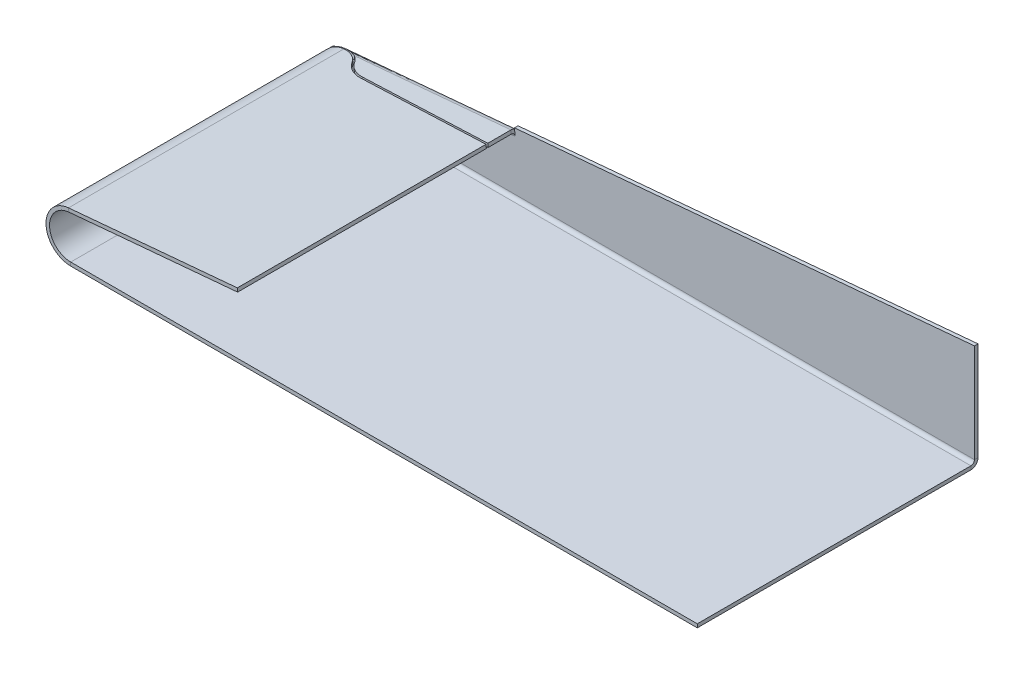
ISO-10303-21;
HEADER;
FILE_DESCRIPTION(('STEP AP214'),'2;1');
FILE_NAME('part.step','',(''),(''),'','','');
FILE_SCHEMA(('AUTOMOTIVE_DESIGN { 1 0 10303 214 1 1 1 1 }'));
ENDSEC;
DATA;
#1=APPLICATION_CONTEXT('core data for automotive mechanical design processes');
#2=APPLICATION_PROTOCOL_DEFINITION('international standard','automotive_design',2000,#1);
#3=PRODUCT_CONTEXT('',#1,'mechanical');
#4=PRODUCT('Part','Part','',(#3));
#5=PRODUCT_RELATED_PRODUCT_CATEGORY('part','',(#4));
#6=PRODUCT_DEFINITION_FORMATION('','',#4);
#7=PRODUCT_DEFINITION_CONTEXT('part definition',#1,'design');
#8=PRODUCT_DEFINITION('design','',#6,#7);
#9=PRODUCT_DEFINITION_SHAPE('','',#8);
#10=(LENGTH_UNIT() NAMED_UNIT(*) SI_UNIT(.MILLI.,.METRE.));
#11=(NAMED_UNIT(*) PLANE_ANGLE_UNIT() SI_UNIT($,.RADIAN.));
#12=(NAMED_UNIT(*) SI_UNIT($,.STERADIAN.) SOLID_ANGLE_UNIT());
#13=UNCERTAINTY_MEASURE_WITH_UNIT(LENGTH_MEASURE(1.E-05),#10,'distance_accuracy_value','');
#14=(GEOMETRIC_REPRESENTATION_CONTEXT(3) GLOBAL_UNCERTAINTY_ASSIGNED_CONTEXT((#13)) GLOBAL_UNIT_ASSIGNED_CONTEXT((#10,
#11,#12)) REPRESENTATION_CONTEXT('',''));
#15=CARTESIAN_POINT('',(0.,0.,0.));
#16=DIRECTION('',(0.,0.,1.));
#17=DIRECTION('',(1.,0.,0.));
#18=AXIS2_PLACEMENT_3D('',#15,#16,#17);
#19=CARTESIAN_POINT('',(69.1480775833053,-165.160090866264,79.));
#20=DIRECTION('',(-0.996024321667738,-0.0890817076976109,0.));
#21=DIRECTION('',(0.0890817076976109,-0.996024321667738,0.));
#22=AXIS2_PLACEMENT_3D('',#19,#20,#21);
#23=PLANE('',#22);
#24=DIRECTION('',(-0.0890817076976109,0.996024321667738,0.));
#25=VECTOR('',#24,1.);
#26=CARTESIAN_POINT('',(69.1480775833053,-165.160090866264,9.013286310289));
#27=LINE('',#26,#25);
#28=CARTESIAN_POINT('',(52.9358370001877,16.1092891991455,9.01328631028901));
#29=VERTEX_POINT('',#28);
#30=CARTESIAN_POINT('',(52.84675529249,17.1053135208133,9.01328631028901));
#31=VERTEX_POINT('',#30);
#32=EDGE_CURVE('E325',#29,#31,#27,.T.);
#33=ORIENTED_EDGE('',*,*,#32,.T.);
#34=DIRECTION('',(0.,0.,1.));
#35=VECTOR('',#34,1.);
#36=CARTESIAN_POINT('',(52.8467552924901,17.1053135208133,79.));
#37=LINE('',#36,#35);
#38=CARTESIAN_POINT('',(52.84675529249,17.1053135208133,79.));
#39=VERTEX_POINT('',#38);
#40=EDGE_CURVE('E321',#31,#39,#37,.T.);
#41=ORIENTED_EDGE('',*,*,#40,.T.);
#42=DIRECTION('',(-0.0890817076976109,0.996024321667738,0.));
#43=VECTOR('',#42,1.);
#44=CARTESIAN_POINT('',(69.1480775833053,-165.160090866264,79.));
#45=LINE('',#44,#43);
#46=CARTESIAN_POINT('',(52.9358370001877,16.1092891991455,79.));
#47=VERTEX_POINT('',#46);
#48=EDGE_CURVE('E307',#47,#39,#45,.T.);
#49=ORIENTED_EDGE('',*,*,#48,.F.);
#50=DIRECTION('',(0.,0.,-1.));
#51=VECTOR('',#50,1.);
#52=CARTESIAN_POINT('',(52.9358370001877,16.1092891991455,79.));
#53=LINE('',#52,#51);
#54=EDGE_CURVE('E295',#29,#47,#53,.F.);
#55=ORIENTED_EDGE('',*,*,#54,.F.);
#56=EDGE_LOOP('',(#33,#41,#49,#55));
#57=FACE_BOUND('',#56,.T.);
#58=ADVANCED_FACE('F39',(#57),#23,.F.);
#59=CARTESIAN_POINT('',(25.1575423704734,-169.094484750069,6.8574243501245));
#60=DIRECTION('',(-0.048560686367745,-0.0043431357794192,0.998810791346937));
#61=DIRECTION('',(-0.99483984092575,-0.0889757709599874,-0.0487545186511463));
#62=AXIS2_PLACEMENT_3D('',#59,#60,#61);
#63=PLANE('',#62);
#64=DIRECTION('',(-0.0890817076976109,0.996024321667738,0.));
#65=VECTOR('',#64,1.);
#66=CARTESIAN_POINT('',(31.9674002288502,-168.485429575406,7.19115780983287));
#67=LINE('',#66,#65);
#68=CARTESIAN_POINT('',(15.7551596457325,12.7839504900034,7.19115780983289));
#69=VERTEX_POINT('',#68);
#70=CARTESIAN_POINT('',(15.6660779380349,13.7799748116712,7.19115780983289));
#71=VERTEX_POINT('',#70);
#72=EDGE_CURVE('E318',#69,#71,#67,.T.);
#73=ORIENTED_EDGE('',*,*,#72,.T.);
#74=DIRECTION('',(-0.99483984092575,-0.0889757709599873,-0.0487545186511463));
#75=VECTOR('',#74,1.);
#76=CARTESIAN_POINT('',(182.264421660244,28.6800777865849,15.355710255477));
#77=LINE('',#76,#75);
#78=EDGE_CURVE('E312',#31,#71,#77,.T.);
#79=ORIENTED_EDGE('',*,*,#78,.F.);
#80=ORIENTED_EDGE('',*,*,#32,.F.);
#81=DIRECTION('',(0.99483984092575,0.0889757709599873,0.0487545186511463));
#82=VECTOR('',#81,1.);
#83=CARTESIAN_POINT('',(8.94530178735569,12.1748953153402,6.85742435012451));
#84=LINE('',#83,#82);
#85=EDGE_CURVE('E299',#69,#29,#84,.T.);
#86=ORIENTED_EDGE('',*,*,#85,.F.);
#87=EDGE_LOOP('',(#73,#79,#80,#86));
#88=FACE_BOUND('',#87,.T.);
#89=ADVANCED_FACE('F353',(#88),#63,.F.);
#90=CARTESIAN_POINT('',(32.304610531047,-168.455270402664,0.255314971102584));
#91=DIRECTION('',(-0.0890817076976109,0.996024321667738,0.));
#92=DIRECTION('',(0.,0.,-1.));
#93=AXIS2_PLACEMENT_3D('',#90,#91,#92);
#94=CYLINDRICAL_SURFACE('',#93,6.94410082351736);
#95=DIRECTION('',(-0.0890817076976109,0.996024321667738,0.));
#96=VECTOR('',#95,1.);
#97=CARTESIAN_POINT('',(26.5639999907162,-168.968695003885,4.12859808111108));
#98=LINE('',#97,#96);
#99=CARTESIAN_POINT('',(10.3517594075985,12.300685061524,4.12859808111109));
#100=VERTEX_POINT('',#99);
#101=CARTESIAN_POINT('',(10.2626776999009,13.2967093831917,4.12859808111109));
#102=VERTEX_POINT('',#101);
#103=EDGE_CURVE('E315',#100,#102,#98,.T.);
#104=ORIENTED_EDGE('',*,*,#103,.T.);
#105=CARTESIAN_POINT('',(16.0032882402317,13.8101339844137,0.255314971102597));
#106=DIRECTION('',(-0.0890817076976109,0.996024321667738,0.));
#107=DIRECTION('',(0.996024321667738,0.0890817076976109,0.));
#108=AXIS2_PLACEMENT_3D('',#105,#106,#107);
#109=CIRCLE('',#108,6.94410082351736);
#110=EDGE_CURVE('E310',#71,#102,#109,.F.);
#111=ORIENTED_EDGE('',*,*,#110,.F.);
#112=ORIENTED_EDGE('',*,*,#72,.F.);
#113=CARTESIAN_POINT('',(16.0923699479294,12.8141096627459,0.255314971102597));
#114=DIRECTION('',(0.0890817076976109,-0.996024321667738,0.));
#115=DIRECTION('',(0.996024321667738,0.0890817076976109,0.));
#116=AXIS2_PLACEMENT_3D('',#113,#114,#115);
#117=CIRCLE('',#116,6.94410082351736);
#118=EDGE_CURVE('E302',#100,#69,#117,.F.);
#119=ORIENTED_EDGE('',*,*,#118,.F.);
#120=EDGE_LOOP('',(#104,#111,#112,#119));
#121=FACE_BOUND('',#120,.T.);
#122=ADVANCED_FACE('F350',(#121),#94,.F.);
#123=CARTESIAN_POINT('',(21.6500782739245,-169.408182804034,7.44410082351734));
#124=DIRECTION('',(-0.0890817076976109,0.996024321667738,0.));
#125=DIRECTION('',(0.,0.,-1.));
#126=AXIS2_PLACEMENT_3D('',#123,#124,#125);
#127=CYLINDRICAL_SURFACE('',#126,5.94410082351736);
#128=CARTESIAN_POINT('',(5.34875598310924,12.8572215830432,1.5));
#129=CARTESIAN_POINT('',(5.43783769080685,11.8611972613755,1.5));
#130=B_SPLINE_CURVE_WITH_KNOTS('',1,(#128,#129),.UNSPECIFIED.,.F.,.F.,(2,2),(0.,1.),.UNSPECIFIED.);
#131=CARTESIAN_POINT('',(5.43783769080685,11.8611972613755,1.5));
#132=VERTEX_POINT('',#131);
#133=CARTESIAN_POINT('',(5.34875598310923,12.8572215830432,1.5));
#134=VERTEX_POINT('',#133);
#135=EDGE_CURVE('E314',#132,#134,#130,.F.);
#136=ORIENTED_EDGE('',*,*,#135,.T.);
#137=CARTESIAN_POINT('',(5.34875598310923,12.8572215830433,7.44410082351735));
#138=DIRECTION('',(-0.0890817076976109,0.996024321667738,0.));
#139=DIRECTION('',(0.996024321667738,0.0890817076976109,0.));
#140=AXIS2_PLACEMENT_3D('',#137,#138,#139);
#141=CIRCLE('',#140,5.94410082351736);
#142=EDGE_CURVE('E309',#102,#134,#141,.T.);
#143=ORIENTED_EDGE('',*,*,#142,.F.);
#144=ORIENTED_EDGE('',*,*,#103,.F.);
#145=CARTESIAN_POINT('',(5.43783769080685,11.8611972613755,7.44410082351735));
#146=DIRECTION('',(0.0890817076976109,-0.996024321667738,0.));
#147=DIRECTION('',(0.996024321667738,0.0890817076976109,0.));
#148=AXIS2_PLACEMENT_3D('',#145,#146,#147);
#149=CIRCLE('',#148,5.94410082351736);
#150=EDGE_CURVE('E11',#132,#100,#149,.T.);
#151=ORIENTED_EDGE('',*,*,#150,.F.);
#152=EDGE_LOOP('',(#136,#143,#144,#151));
#153=FACE_BOUND('',#152,.T.);
#154=ADVANCED_FACE('F342',(#153),#127,.T.);
#155=CARTESIAN_POINT('',(5.34875598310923,12.8572215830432,79.));
#156=DIRECTION('',(0.0890817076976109,-0.996024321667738,0.));
#157=DIRECTION('',(0.996024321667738,0.0890817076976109,0.));
#158=AXIS2_PLACEMENT_3D('',#155,#156,#157);
#159=PLANE('',#158);
#160=ORIENTED_EDGE('',*,*,#78,.T.);
#161=ORIENTED_EDGE('',*,*,#110,.T.);
#162=ORIENTED_EDGE('',*,*,#142,.T.);
#163=DIRECTION('',(0.,0.,-1.));
#164=VECTOR('',#163,1.);
#165=CARTESIAN_POINT('',(5.34875598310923,12.8572215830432,79.));
#166=LINE('',#165,#164);
#167=CARTESIAN_POINT('',(5.34875598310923,12.8572215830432,79.));
#168=VERTEX_POINT('',#167);
#169=EDGE_CURVE('E255',#168,#134,#166,.T.);
#170=ORIENTED_EDGE('',*,*,#169,.F.);
#171=DIRECTION('',(-0.996024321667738,-0.0890817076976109,0.));
#172=VECTOR('',#171,1.);
#173=CARTESIAN_POINT('',(5.34875598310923,12.8572215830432,79.));
#174=LINE('',#173,#172);
#175=EDGE_CURVE('E305',#39,#168,#174,.T.);
#176=ORIENTED_EDGE('',*,*,#175,.F.);
#177=ORIENTED_EDGE('',*,*,#40,.F.);
#178=EDGE_LOOP('',(#160,#161,#162,#170,#176,#177));
#179=FACE_BOUND('',#178,.T.);
#180=ADVANCED_FACE('F345',(#179),#159,.F.);
#181=CARTESIAN_POINT('',(21.6500782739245,-169.408182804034,79.));
#182=DIRECTION('',(0.,0.,-1.));
#183=DIRECTION('',(0.089081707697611,-0.996024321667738,0.));
#184=AXIS2_PLACEMENT_3D('',#181,#182,#183);
#185=PLANE('',#184);
#186=ORIENTED_EDGE('',*,*,#48,.T.);
#187=ORIENTED_EDGE('',*,*,#175,.T.);
#188=DIRECTION('',(-0.0890817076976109,0.996024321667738,0.));
#189=VECTOR('',#188,1.);
#190=CARTESIAN_POINT('',(21.6500782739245,-169.408182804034,79.));
#191=LINE('',#190,#189);
#192=CARTESIAN_POINT('',(5.43783769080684,11.8611972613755,79.));
#193=VERTEX_POINT('',#192);
#194=EDGE_CURVE('E91',#193,#168,#191,.T.);
#195=ORIENTED_EDGE('',*,*,#194,.F.);
#196=DIRECTION('',(-0.996024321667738,-0.0890817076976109,0.));
#197=VECTOR('',#196,1.);
#198=CARTESIAN_POINT('',(5.43783769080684,11.8611972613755,79.));
#199=LINE('',#198,#197);
#200=EDGE_CURVE('E60',#47,#193,#199,.T.);
#201=ORIENTED_EDGE('',*,*,#200,.F.);
#202=EDGE_LOOP('',(#186,#187,#195,#201));
#203=FACE_BOUND('',#202,.T.);
#204=ADVANCED_FACE('F704',(#203),#185,.F.);
#205=CARTESIAN_POINT('',(5.43783769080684,11.8611972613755,79.));
#206=DIRECTION('',(0.0890817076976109,-0.996024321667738,0.));
#207=DIRECTION('',(0.996024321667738,0.0890817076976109,0.));
#208=AXIS2_PLACEMENT_3D('',#205,#206,#207);
#209=PLANE('',#208);
#210=ORIENTED_EDGE('',*,*,#118,.T.);
#211=ORIENTED_EDGE('',*,*,#85,.T.);
#212=ORIENTED_EDGE('',*,*,#54,.T.);
#213=ORIENTED_EDGE('',*,*,#200,.T.);
#214=DIRECTION('',(0.,0.,-1.));
#215=VECTOR('',#214,1.);
#216=CARTESIAN_POINT('',(5.43783769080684,11.8611972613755,79.));
#217=LINE('',#216,#215);
#218=EDGE_CURVE('E51',#193,#132,#217,.T.);
#219=ORIENTED_EDGE('',*,*,#218,.T.);
#220=ORIENTED_EDGE('',*,*,#150,.T.);
#221=EDGE_LOOP('',(#210,#211,#212,#213,#219,#220));
#222=FACE_BOUND('',#221,.T.);
#223=ADVANCED_FACE('F41',(#222),#209,.T.);
#224=CARTESIAN_POINT('',(24.1597591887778,-77.3875277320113,0.255314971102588));
#225=DIRECTION('',(-0.089081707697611,0.996024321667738,0.));
#226=DIRECTION('',(0.0887275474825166,0.00793555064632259,0.996024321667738));
#227=AXIS2_PLACEMENT_3D('',#224,#225,#226);
#228=CYLINDRICAL_SURFACE('',#227,6.44410082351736);
#229=CARTESIAN_POINT('',(16.0032882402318,13.8101339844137,0.255314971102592));
#230=DIRECTION('',(0.089081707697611,-0.996024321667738,0.));
#231=DIRECTION('',(0.996024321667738,0.089081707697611,0.));
#232=AXIS2_PLACEMENT_3D('',#229,#230,#231);
#233=CIRCLE('',#232,6.44410082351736);
#234=CARTESIAN_POINT('',(15.6903582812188,13.7821463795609,6.69175241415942));
#235=VERTEX_POINT('',#234);
#236=CARTESIAN_POINT('',(10.6760221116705,13.3336777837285,3.84970789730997));
#237=VERTEX_POINT('',#236);
#238=EDGE_CURVE('E1089',#235,#237,#233,.T.);
#239=ORIENTED_EDGE('',*,*,#238,.T.);
#240=DIRECTION('',(-0.089081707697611,0.996024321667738,0.));
#241=VECTOR('',#240,1.);
#242=CARTESIAN_POINT('',(18.8324930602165,-77.8639839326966,3.84970789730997));
#243=LINE('',#242,#241);
#244=CARTESIAN_POINT('',(10.7651038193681,12.3376534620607,3.84970789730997));
#245=VERTEX_POINT('',#244);
#246=EDGE_CURVE('E1070',#245,#237,#243,.T.);
#247=ORIENTED_EDGE('',*,*,#246,.F.);
#248=CARTESIAN_POINT('',(16.0923699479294,12.8141096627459,0.255314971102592));
#249=DIRECTION('',(0.089081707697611,-0.996024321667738,0.));
#250=DIRECTION('',(0.996024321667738,0.089081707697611,0.));
#251=AXIS2_PLACEMENT_3D('',#248,#249,#250);
#252=CIRCLE('',#251,6.44410082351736);
#253=CARTESIAN_POINT('',(15.7794399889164,12.7861220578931,6.69175241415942));
#254=VERTEX_POINT('',#253);
#255=EDGE_CURVE('E104',#245,#254,#252,.F.);
#256=ORIENTED_EDGE('',*,*,#255,.T.);
#257=DIRECTION('',(-0.089081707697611,0.996024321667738,0.));
#258=VECTOR('',#257,1.);
#259=CARTESIAN_POINT('',(23.8468292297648,-77.4155153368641,6.69175241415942));
#260=LINE('',#259,#258);
#261=EDGE_CURVE('E1086',#254,#235,#260,.T.);
#262=ORIENTED_EDGE('',*,*,#261,.T.);
#263=EDGE_LOOP('',(#239,#247,#256,#262));
#264=FACE_BOUND('',#263,.T.);
#265=ADVANCED_FACE('F603',(#264),#228,.T.);
#266=CARTESIAN_POINT('',(17.036971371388,-78.0245705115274,6.35801895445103));
#267=DIRECTION('',(-0.048560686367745,-0.00434313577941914,0.998810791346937));
#268=DIRECTION('',(-0.99483984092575,-0.0889757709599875,-0.0487545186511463));
#269=AXIS2_PLACEMENT_3D('',#266,#267,#268);
#270=PLANE('',#269);
#271=DIRECTION('',(-0.99483984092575,-0.0889757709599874,-0.0487545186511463));
#272=VECTOR('',#271,1.);
#273=CARTESIAN_POINT('',(182.288702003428,28.6822493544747,14.8563048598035));
#274=LINE('',#273,#272);
#275=CARTESIAN_POINT('',(52.8467552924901,17.1053135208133,8.51269099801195));
#276=VERTEX_POINT('',#275);
#277=EDGE_CURVE('E125',#276,#235,#274,.T.);
#278=ORIENTED_EDGE('',*,*,#277,.T.);
#279=ORIENTED_EDGE('',*,*,#261,.F.);
#280=DIRECTION('',(0.99483984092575,0.0889757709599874,0.0487545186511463));
#281=VECTOR('',#280,1.);
#282=CARTESIAN_POINT('',(8.96958213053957,12.1770668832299,6.35801895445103));
#283=LINE('',#282,#281);
#284=CARTESIAN_POINT('',(52.9358370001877,16.1092891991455,8.51269099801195));
#285=VERTEX_POINT('',#284);
#286=EDGE_CURVE('E1082',#254,#285,#283,.T.);
#287=ORIENTED_EDGE('',*,*,#286,.T.);
#288=DIRECTION('',(-0.089081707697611,0.996024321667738,0.));
#289=VECTOR('',#288,1.);
#290=CARTESIAN_POINT('',(61.0032262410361,-74.0923481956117,8.51269099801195));
#291=LINE('',#290,#289);
#292=EDGE_CURVE('E1080',#285,#276,#291,.T.);
#293=ORIENTED_EDGE('',*,*,#292,.T.);
#294=EDGE_LOOP('',(#278,#279,#287,#293));
#295=FACE_BOUND('',#294,.T.);
#296=ADVANCED_FACE('F606',(#295),#270,.T.);
#297=CARTESIAN_POINT('',(61.0032262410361,-74.0923481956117,79.));
#298=DIRECTION('',(-0.996024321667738,-0.089081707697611,0.));
#299=DIRECTION('',(0.,0.,-1.));
#300=AXIS2_PLACEMENT_3D('',#297,#298,#299);
#301=PLANE('',#300);
#302=DIRECTION('',(-0.089081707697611,0.996024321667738,0.));
#303=VECTOR('',#302,1.);
#304=CARTESIAN_POINT('',(61.0032262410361,-74.0923481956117,1.99999999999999));
#305=LINE('',#304,#303);
#306=CARTESIAN_POINT('',(52.9358370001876,16.1092891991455,2.));
#307=VERTEX_POINT('',#306);
#308=CARTESIAN_POINT('',(52.84675529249,17.1053135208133,2.));
#309=VERTEX_POINT('',#308);
#310=EDGE_CURVE('E1058',#307,#309,#305,.T.);
#311=ORIENTED_EDGE('',*,*,#310,.T.);
#312=DIRECTION('',(0.,0.,1.));
#313=VECTOR('',#312,1.);
#314=CARTESIAN_POINT('',(52.8467552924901,17.1053135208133,79.));
#315=LINE('',#314,#313);
#316=EDGE_CURVE('E1052',#309,#276,#315,.T.);
#317=ORIENTED_EDGE('',*,*,#316,.T.);
#318=ORIENTED_EDGE('',*,*,#292,.F.);
#319=DIRECTION('',(0.,0.,-1.));
#320=VECTOR('',#319,1.);
#321=CARTESIAN_POINT('',(52.9358370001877,16.1092891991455,79.));
#322=LINE('',#321,#320);
#323=EDGE_CURVE('E329',#307,#285,#322,.F.);
#324=ORIENTED_EDGE('',*,*,#323,.F.);
#325=EDGE_LOOP('',(#311,#317,#318,#324));
#326=FACE_BOUND('',#325,.T.);
#327=ADVANCED_FACE('F610',(#326),#301,.F.);
#328=CARTESIAN_POINT('',(5.34875598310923,12.8572215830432,79.));
#329=DIRECTION('',(0.089081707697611,-0.996024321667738,0.));
#330=DIRECTION('',(0.996024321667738,0.089081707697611,0.));
#331=AXIS2_PLACEMENT_3D('',#328,#329,#330);
#332=PLANE('',#331);
#333=ORIENTED_EDGE('',*,*,#316,.F.);
#334=DIRECTION('',(-0.996024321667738,-0.089081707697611,0.));
#335=VECTOR('',#334,1.);
#336=CARTESIAN_POINT('',(52.8467552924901,17.1053135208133,1.99999999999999));
#337=LINE('',#336,#335);
#338=CARTESIAN_POINT('',(8.78297528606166,13.1643688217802,2.));
#339=VERTEX_POINT('',#338);
#340=EDGE_CURVE('E1048',#309,#339,#337,.T.);
#341=ORIENTED_EDGE('',*,*,#340,.T.);
#342=CARTESIAN_POINT('',(5.34875598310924,12.8572215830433,7.44410082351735));
#343=DIRECTION('',(-0.089081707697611,0.996024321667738,0.));
#344=DIRECTION('',(-0.996024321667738,-0.089081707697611,0.));
#345=AXIS2_PLACEMENT_3D('',#342,#343,#344);
#346=CIRCLE('',#345,6.44410082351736);
#347=EDGE_CURVE('E1051',#237,#339,#346,.T.);
#348=ORIENTED_EDGE('',*,*,#347,.F.);
#349=ORIENTED_EDGE('',*,*,#238,.F.);
#350=ORIENTED_EDGE('',*,*,#277,.F.);
#351=EDGE_LOOP('',(#333,#341,#348,#349,#350));
#352=FACE_BOUND('',#351,.T.);
#353=ADVANCED_FACE('F613',(#352),#332,.F.);
#354=CARTESIAN_POINT('',(13.5052269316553,-78.3404401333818,7.44410082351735));
#355=DIRECTION('',(-0.089081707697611,0.996024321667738,0.));
#356=DIRECTION('',(0.0887275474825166,0.00793555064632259,0.996024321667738));
#357=AXIS2_PLACEMENT_3D('',#354,#355,#356);
#358=CYLINDRICAL_SURFACE('',#357,6.44410082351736);
#359=ORIENTED_EDGE('',*,*,#347,.T.);
#360=CARTESIAN_POINT('',(8.87205699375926,12.1683445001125,2.));
#361=CARTESIAN_POINT('',(8.78297528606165,13.1643688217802,2.));
#362=B_SPLINE_CURVE_WITH_KNOTS('',1,(#360,#361),.UNSPECIFIED.,.F.,.F.,(2,2),(0.,1.),.UNSPECIFIED.);
#363=CARTESIAN_POINT('',(8.87205699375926,12.1683445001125,2.));
#364=VERTEX_POINT('',#363);
#365=EDGE_CURVE('E1067',#364,#339,#362,.T.);
#366=ORIENTED_EDGE('',*,*,#365,.F.);
#367=CARTESIAN_POINT('',(5.43783769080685,11.8611972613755,7.44410082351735));
#368=DIRECTION('',(0.089081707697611,-0.996024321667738,0.));
#369=DIRECTION('',(-0.0887275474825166,-0.00793555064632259,-0.996024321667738));
#370=AXIS2_PLACEMENT_3D('',#367,#368,#369);
#371=CIRCLE('',#370,6.44410082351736);
#372=EDGE_CURVE('E1055',#364,#245,#371,.T.);
#373=ORIENTED_EDGE('',*,*,#372,.T.);
#374=ORIENTED_EDGE('',*,*,#246,.T.);
#375=EDGE_LOOP('',(#359,#366,#373,#374));
#376=FACE_BOUND('',#375,.T.);
#377=ADVANCED_FACE('F617',(#376),#358,.F.);
#378=CARTESIAN_POINT('',(5.43783769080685,11.8611972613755,79.));
#379=DIRECTION('',(0.089081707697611,-0.996024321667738,0.));
#380=DIRECTION('',(0.996024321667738,0.089081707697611,0.));
#381=AXIS2_PLACEMENT_3D('',#378,#379,#380);
#382=PLANE('',#381);
#383=DIRECTION('',(-0.996024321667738,-0.089081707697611,0.));
#384=VECTOR('',#383,1.);
#385=CARTESIAN_POINT('',(52.9358370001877,16.1092891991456,1.99999999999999));
#386=LINE('',#385,#384);
#387=EDGE_CURVE('E1065',#307,#364,#386,.T.);
#388=ORIENTED_EDGE('',*,*,#387,.F.);
#389=ORIENTED_EDGE('',*,*,#323,.T.);
#390=ORIENTED_EDGE('',*,*,#286,.F.);
#391=ORIENTED_EDGE('',*,*,#255,.F.);
#392=ORIENTED_EDGE('',*,*,#372,.F.);
#393=EDGE_LOOP('',(#388,#389,#390,#391,#392));
#394=FACE_BOUND('',#393,.T.);
#395=ADVANCED_FACE('F622',(#394),#382,.T.);
#396=CARTESIAN_POINT('',(52.8467552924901,17.1053135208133,0.999999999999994));
#397=DIRECTION('',(0.996024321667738,0.0890817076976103,0.));
#398=DIRECTION('',(-0.0890817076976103,0.996024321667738,0.));
#399=AXIS2_PLACEMENT_3D('',#396,#397,#398);
#400=PLANE('',#399);
#401=CARTESIAN_POINT('',(53.0249187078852,15.1132648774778,2.));
#402=DIRECTION('',(-0.996024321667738,-0.089081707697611,0.));
#403=DIRECTION('',(0.089081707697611,-0.996024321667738,0.));
#404=AXIS2_PLACEMENT_3D('',#401,#402,#403);
#405=CIRCLE('',#404,2.);
#406=CARTESIAN_POINT('',(52.8706246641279,16.8384296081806,0.999999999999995));
#407=VERTEX_POINT('',#406);
#408=CARTESIAN_POINT('',(53.0249187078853,15.1132648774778,0.));
#409=VERTEX_POINT('',#408);
#410=EDGE_CURVE('E141',#407,#409,#405,.T.);
#411=ORIENTED_EDGE('',*,*,#410,.F.);
#412=DIRECTION('',(0.0890817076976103,-0.996024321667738,0.));
#413=VECTOR('',#412,1.);
#414=CARTESIAN_POINT('',(52.8467552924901,17.1053135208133,0.999999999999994));
#415=LINE('',#414,#413);
#416=CARTESIAN_POINT('',(52.8467552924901,17.1053135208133,0.999999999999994));
#417=VERTEX_POINT('',#416);
#418=EDGE_CURVE('E514',#417,#407,#415,.T.);
#419=ORIENTED_EDGE('',*,*,#418,.F.);
#420=DIRECTION('',(0.,0.,-1.));
#421=VECTOR('',#420,1.);
#422=CARTESIAN_POINT('',(52.8467552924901,17.1053135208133,0.999999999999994));
#423=LINE('',#422,#421);
#424=CARTESIAN_POINT('',(52.8467552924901,17.1053135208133,0.));
#425=VERTEX_POINT('',#424);
#426=EDGE_CURVE('E523',#417,#425,#423,.T.);
#427=ORIENTED_EDGE('',*,*,#426,.T.);
#428=DIRECTION('',(0.0890817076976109,-0.996024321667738,0.));
#429=VECTOR('',#428,1.);
#430=CARTESIAN_POINT('',(52.8467552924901,17.1053135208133,0.));
#431=LINE('',#430,#429);
#432=EDGE_CURVE('E564',#425,#409,#431,.T.);
#433=ORIENTED_EDGE('',*,*,#432,.T.);
#434=EDGE_LOOP('',(#411,#419,#427,#433));
#435=FACE_BOUND('',#434,.T.);
#436=ADVANCED_FACE('F487',(#435),#400,.F.);
#437=CARTESIAN_POINT('',(5.96922459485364,5.91974986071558,372.359627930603));
#438=DIRECTION('',(0.,0.,-1.));
#439=DIRECTION('',(1.,0.,0.));
#440=AXIS2_PLACEMENT_3D('',#437,#438,#439);
#441=CYLINDRICAL_SURFACE('',#440,6.96516296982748);
#442=CARTESIAN_POINT('',(0.661602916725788,10.4300322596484,0.));
#443=CARTESIAN_POINT('',(0.661602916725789,10.4300322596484,0.999999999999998));
#444=B_SPLINE_CURVE_WITH_KNOTS('',1,(#442,#443),.UNSPECIFIED.,.F.,.F.,(2,2),(0.,1.),.UNSPECIFIED.);
#445=CARTESIAN_POINT('',(0.66160291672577,10.4300322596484,1.));
#446=VERTEX_POINT('',#445);
#447=CARTESIAN_POINT('',(0.661602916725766,10.4300322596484,0.));
#448=VERTEX_POINT('',#447);
#449=EDGE_CURVE('E510',#446,#448,#444,.F.);
#450=ORIENTED_EDGE('',*,*,#449,.T.);
#451=CARTESIAN_POINT('',(5.96922459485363,5.91974986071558,0.));
#452=DIRECTION('',(0.,0.,1.));
#453=DIRECTION('',(1.,0.,0.));
#454=AXIS2_PLACEMENT_3D('',#451,#452,#453);
#455=CIRCLE('',#454,6.96516296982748);
#456=CARTESIAN_POINT('',(5.96922459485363,-1.0454131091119,0.));
#457=VERTEX_POINT('',#456);
#458=EDGE_CURVE('E557',#448,#457,#455,.T.);
#459=ORIENTED_EDGE('',*,*,#458,.T.);
#460=DIRECTION('',(0.,0.,-1.));
#461=VECTOR('',#460,1.);
#462=CARTESIAN_POINT('',(5.96922459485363,-1.0454131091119,1.00000000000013));
#463=LINE('',#462,#461);
#464=CARTESIAN_POINT('',(5.96922459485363,-1.0454131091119,1.00000000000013));
#465=VERTEX_POINT('',#464);
#466=EDGE_CURVE('E549',#465,#457,#463,.T.);
#467=ORIENTED_EDGE('',*,*,#466,.F.);
#468=CARTESIAN_POINT('',(5.96922459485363,5.91974986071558,1.));
#469=DIRECTION('',(0.,0.,-1.));
#470=DIRECTION('',(-1.,0.,0.));
#471=AXIS2_PLACEMENT_3D('',#468,#469,#470);
#472=CIRCLE('',#471,6.96516296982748);
#473=EDGE_CURVE('E572',#465,#446,#472,.T.);
#474=ORIENTED_EDGE('',*,*,#473,.T.);
#475=EDGE_LOOP('',(#450,#459,#467,#474));
#476=FACE_BOUND('',#475,.T.);
#477=ADVANCED_FACE('F591',(#476),#441,.T.);
#478=CARTESIAN_POINT('',(182.288702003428,28.6822493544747,372.359627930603));
#479=DIRECTION('',(-1.,0.,0.));
#480=DIRECTION('',(0.,0.,-1.));
#481=AXIS2_PLACEMENT_3D('',#478,#479,#480);
#482=PLANE('',#481);
#483=DIRECTION('',(0.,-1.,0.));
#484=VECTOR('',#483,1.);
#485=CARTESIAN_POINT('',(182.288702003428,-0.045413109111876,0.));
#486=LINE('',#485,#484);
#487=CARTESIAN_POINT('',(182.288702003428,28.6822493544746,0.));
#488=VERTEX_POINT('',#487);
#489=CARTESIAN_POINT('',(182.288702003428,0.954586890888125,0.));
#490=VERTEX_POINT('',#489);
#491=EDGE_CURVE('E555',#488,#490,#486,.T.);
#492=ORIENTED_EDGE('',*,*,#491,.F.);
#493=DIRECTION('',(0.,0.,-1.));
#494=VECTOR('',#493,1.);
#495=CARTESIAN_POINT('',(182.288702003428,28.6822493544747,372.359627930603));
#496=LINE('',#495,#494);
#497=CARTESIAN_POINT('',(182.288702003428,28.6822493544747,1.0000000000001));
#498=VERTEX_POINT('',#497);
#499=EDGE_CURVE('E528',#498,#488,#496,.T.);
#500=ORIENTED_EDGE('',*,*,#499,.F.);
#501=DIRECTION('',(0.,1.,0.));
#502=VECTOR('',#501,1.);
#503=CARTESIAN_POINT('',(182.288702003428,28.6822493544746,0.999999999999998));
#504=LINE('',#503,#502);
#505=CARTESIAN_POINT('',(182.288702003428,0.954586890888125,0.999999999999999));
#506=VERTEX_POINT('',#505);
#507=EDGE_CURVE('E566',#506,#498,#504,.T.);
#508=ORIENTED_EDGE('',*,*,#507,.F.);
#509=DIRECTION('',(0.,0.,-1.));
#510=VECTOR('',#509,1.);
#511=CARTESIAN_POINT('',(182.288702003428,0.954586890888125,0.999999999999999));
#512=LINE('',#511,#510);
#513=EDGE_CURVE('E547',#506,#490,#512,.T.);
#514=ORIENTED_EDGE('',*,*,#513,.T.);
#515=EDGE_LOOP('',(#492,#500,#508,#514));
#516=FACE_BOUND('',#515,.T.);
#517=ADVANCED_FACE('F601',(#516),#482,.F.);
#518=CARTESIAN_POINT('',(5.34875598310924,12.8572215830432,372.359627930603));
#519=DIRECTION('',(0.0890817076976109,-0.996024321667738,0.));
#520=DIRECTION('',(0.996024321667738,0.0890817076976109,0.));
#521=AXIS2_PLACEMENT_3D('',#518,#519,#520);
#522=PLANE('',#521);
#523=DIRECTION('',(-0.996024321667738,-0.0890817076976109,0.));
#524=VECTOR('',#523,1.);
#525=CARTESIAN_POINT('',(5.34875598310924,12.8572215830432,0.));
#526=LINE('',#525,#524);
#527=EDGE_CURVE('E546',#488,#425,#526,.T.);
#528=ORIENTED_EDGE('',*,*,#527,.T.);
#529=ORIENTED_EDGE('',*,*,#426,.F.);
#530=DIRECTION('',(-0.996024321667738,-0.0890817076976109,0.));
#531=VECTOR('',#530,1.);
#532=CARTESIAN_POINT('',(5.34875598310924,12.8572215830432,1.));
#533=LINE('',#532,#531);
#534=EDGE_CURVE('E569',#498,#417,#533,.T.);
#535=ORIENTED_EDGE('',*,*,#534,.F.);
#536=ORIENTED_EDGE('',*,*,#499,.T.);
#537=EDGE_LOOP('',(#528,#529,#535,#536));
#538=FACE_BOUND('',#537,.T.);
#539=ADVANCED_FACE('F684',(#538),#522,.F.);
#540=CARTESIAN_POINT('',(5.96922459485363,5.91974986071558,1.));
#541=DIRECTION('',(0.,0.,1.));
#542=DIRECTION('',(1.,0.,0.));
#543=AXIS2_PLACEMENT_3D('',#540,#541,#542);
#544=PLANE('',#543);
#545=ORIENTED_EDGE('',*,*,#418,.T.);
#546=CARTESIAN_POINT('',(53.0249187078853,15.1132648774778,0.999999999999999));
#547=VERTEX_POINT('',#546);
#548=EDGE_CURVE('E522',#407,#547,#415,.T.);
#549=ORIENTED_EDGE('',*,*,#548,.T.);
#550=DIRECTION('',(-0.996024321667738,-0.089081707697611,0.));
#551=VECTOR('',#550,1.);
#552=CARTESIAN_POINT('',(53.0249187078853,15.1132648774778,0.999999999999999));
#553=LINE('',#552,#551);
#554=EDGE_CURVE('E577',#547,#446,#553,.T.);
#555=ORIENTED_EDGE('',*,*,#554,.T.);
#556=ORIENTED_EDGE('',*,*,#473,.F.);
#557=DIRECTION('',(0.,-1.,0.));
#558=VECTOR('',#557,1.);
#559=CARTESIAN_POINT('',(5.96922459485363,0.954586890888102,1.00000000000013));
#560=LINE('',#559,#558);
#561=CARTESIAN_POINT('',(5.96922459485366,-0.777463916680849,1.00000000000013));
#562=VERTEX_POINT('',#561);
#563=EDGE_CURVE('E243',#562,#465,#560,.T.);
#564=ORIENTED_EDGE('',*,*,#563,.F.);
#565=CARTESIAN_POINT('',(5.96922459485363,0.954586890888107,1.00000000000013));
#566=VERTEX_POINT('',#565);
#567=EDGE_CURVE('E275',#566,#562,#560,.T.);
#568=ORIENTED_EDGE('',*,*,#567,.F.);
#569=DIRECTION('',(-1.,0.,0.));
#570=VECTOR('',#569,1.);
#571=CARTESIAN_POINT('',(182.288702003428,0.954586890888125,0.999999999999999));
#572=LINE('',#571,#570);
#573=EDGE_CURVE('E543',#506,#566,#572,.T.);
#574=ORIENTED_EDGE('',*,*,#573,.F.);
#575=ORIENTED_EDGE('',*,*,#507,.T.);
#576=ORIENTED_EDGE('',*,*,#534,.T.);
#577=EDGE_LOOP('',(#545,#549,#555,#556,#564,#568,#574,#575,#576));
#578=FACE_BOUND('',#577,.T.);
#579=ADVANCED_FACE('F681',(#578),#544,.T.);
#580=CARTESIAN_POINT('',(5.96922459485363,-0.0454131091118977,0.));
#581=DIRECTION('',(0.,0.,-1.));
#582=DIRECTION('',(-1.,0.,0.));
#583=AXIS2_PLACEMENT_3D('',#580,#581,#582);
#584=PLANE('',#583);
#585=ORIENTED_EDGE('',*,*,#432,.F.);
#586=ORIENTED_EDGE('',*,*,#527,.F.);
#587=ORIENTED_EDGE('',*,*,#491,.T.);
#588=DIRECTION('',(1.,0.,0.));
#589=VECTOR('',#588,1.);
#590=CARTESIAN_POINT('',(182.288702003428,0.954586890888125,0.));
#591=LINE('',#590,#589);
#592=CARTESIAN_POINT('',(5.96922459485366,0.95458689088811,0.));
#593=VERTEX_POINT('',#592);
#594=EDGE_CURVE('E558',#593,#490,#591,.T.);
#595=ORIENTED_EDGE('',*,*,#594,.F.);
#596=DIRECTION('',(0.,-1.,0.));
#597=VECTOR('',#596,1.);
#598=CARTESIAN_POINT('',(5.96922459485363,-0.0454131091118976,0.));
#599=LINE('',#598,#597);
#600=EDGE_CURVE('E560',#593,#457,#599,.T.);
#601=ORIENTED_EDGE('',*,*,#600,.T.);
#602=ORIENTED_EDGE('',*,*,#458,.F.);
#603=DIRECTION('',(0.996024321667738,0.089081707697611,0.));
#604=VECTOR('',#603,1.);
#605=CARTESIAN_POINT('',(53.0249187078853,15.1132648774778,0.));
#606=LINE('',#605,#604);
#607=EDGE_CURVE('E563',#448,#409,#606,.T.);
#608=ORIENTED_EDGE('',*,*,#607,.T.);
#609=EDGE_LOOP('',(#585,#586,#587,#595,#601,#602,#608));
#610=FACE_BOUND('',#609,.T.);
#611=ADVANCED_FACE('F678',(#610),#584,.T.);
#612=CARTESIAN_POINT('',(5.96922459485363,0.954586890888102,1.00000000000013));
#613=DIRECTION('',(1.,0.,0.));
#614=DIRECTION('',(0.,0.,1.));
#615=AXIS2_PLACEMENT_3D('',#612,#613,#614);
#616=PLANE('',#615);
#617=CARTESIAN_POINT('',(5.96922459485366,0.954586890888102,2.));
#618=DIRECTION('',(-1.,0.,0.));
#619=DIRECTION('',(0.,-1.,0.));
#620=AXIS2_PLACEMENT_3D('',#617,#618,#619);
#621=CIRCLE('',#620,2.);
#622=EDGE_CURVE('E149',#562,#593,#621,.F.);
#623=ORIENTED_EDGE('',*,*,#622,.F.);
#624=ORIENTED_EDGE('',*,*,#563,.T.);
#625=ORIENTED_EDGE('',*,*,#466,.T.);
#626=ORIENTED_EDGE('',*,*,#600,.F.);
#627=EDGE_LOOP('',(#623,#624,#625,#626));
#628=FACE_BOUND('',#627,.T.);
#629=ADVANCED_FACE('F665',(#628),#616,.T.);
#630=CARTESIAN_POINT('',(182.288702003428,384.753537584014,79.));
#631=DIRECTION('',(0.,0.,-1.));
#632=DIRECTION('',(-1.,0.,0.));
#633=AXIS2_PLACEMENT_3D('',#630,#631,#632);
#634=PLANE('',#633);
#635=DIRECTION('',(0.,-1.,0.));
#636=VECTOR('',#635,1.);
#637=CARTESIAN_POINT('',(5.96922459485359,384.753537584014,79.));
#638=LINE('',#637,#636);
#639=CARTESIAN_POINT('',(5.96922459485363,-0.0454131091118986,79.));
#640=VERTEX_POINT('',#639);
#641=CARTESIAN_POINT('',(5.96922459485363,-1.0454131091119,79.));
#642=VERTEX_POINT('',#641);
#643=EDGE_CURVE('E284',#640,#642,#638,.T.);
#644=ORIENTED_EDGE('',*,*,#643,.T.);
#645=DIRECTION('',(1.,0.,0.));
#646=VECTOR('',#645,1.);
#647=CARTESIAN_POINT('',(182.288702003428,-1.04541310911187,79.));
#648=LINE('',#647,#646);
#649=CARTESIAN_POINT('',(182.288702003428,-1.04541310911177,79.));
#650=VERTEX_POINT('',#649);
#651=EDGE_CURVE('E267',#642,#650,#648,.T.);
#652=ORIENTED_EDGE('',*,*,#651,.T.);
#653=DIRECTION('',(0.,-1.,0.));
#654=VECTOR('',#653,1.);
#655=CARTESIAN_POINT('',(182.288702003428,384.753537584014,79.));
#656=LINE('',#655,#654);
#657=CARTESIAN_POINT('',(182.288702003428,-0.0454131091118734,79.));
#658=VERTEX_POINT('',#657);
#659=EDGE_CURVE('E269',#658,#650,#656,.T.);
#660=ORIENTED_EDGE('',*,*,#659,.F.);
#661=DIRECTION('',(1.,0.,0.));
#662=VECTOR('',#661,1.);
#663=CARTESIAN_POINT('',(182.288702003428,-0.0454131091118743,79.));
#664=LINE('',#663,#662);
#665=EDGE_CURVE('E531',#640,#658,#664,.T.);
#666=ORIENTED_EDGE('',*,*,#665,.F.);
#667=EDGE_LOOP('',(#644,#652,#660,#666));
#668=FACE_BOUND('',#667,.T.);
#669=ADVANCED_FACE('F662',(#668),#634,.F.);
#670=CARTESIAN_POINT('',(182.288702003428,-1.04541310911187,79.));
#671=DIRECTION('',(0.,1.,0.));
#672=DIRECTION('',(-1.,0.,0.));
#673=AXIS2_PLACEMENT_3D('',#670,#671,#672);
#674=PLANE('',#673);
#675=DIRECTION('',(-1.,0.,0.));
#676=VECTOR('',#675,1.);
#677=CARTESIAN_POINT('',(182.288702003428,-1.04541310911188,2.));
#678=LINE('',#677,#676);
#679=CARTESIAN_POINT('',(182.288702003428,-1.04541310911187,2.));
#680=VERTEX_POINT('',#679);
#681=CARTESIAN_POINT('',(5.96922459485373,-1.04541310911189,2.));
#682=VERTEX_POINT('',#681);
#683=EDGE_CURVE('E264',#680,#682,#678,.T.);
#684=ORIENTED_EDGE('',*,*,#683,.F.);
#685=DIRECTION('',(0.,0.,-1.));
#686=VECTOR('',#685,1.);
#687=CARTESIAN_POINT('',(182.288702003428,-1.04541310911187,79.));
#688=LINE('',#687,#686);
#689=EDGE_CURVE('E538',#650,#680,#688,.T.);
#690=ORIENTED_EDGE('',*,*,#689,.F.);
#691=ORIENTED_EDGE('',*,*,#651,.F.);
#692=DIRECTION('',(0.,0.,-1.));
#693=VECTOR('',#692,1.);
#694=CARTESIAN_POINT('',(5.96922459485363,-1.0454131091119,79.));
#695=LINE('',#694,#693);
#696=EDGE_CURVE('E253',#642,#682,#695,.T.);
#697=ORIENTED_EDGE('',*,*,#696,.T.);
#698=EDGE_LOOP('',(#684,#690,#691,#697));
#699=FACE_BOUND('',#698,.T.);
#700=ADVANCED_FACE('F262',(#699),#674,.F.);
#701=CARTESIAN_POINT('',(182.288702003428,384.753537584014,79.));
#702=DIRECTION('',(-1.,0.,0.));
#703=DIRECTION('',(0.,-1.,0.));
#704=AXIS2_PLACEMENT_3D('',#701,#702,#703);
#705=PLANE('',#704);
#706=ORIENTED_EDGE('',*,*,#659,.T.);
#707=ORIENTED_EDGE('',*,*,#689,.T.);
#708=DIRECTION('',(0.,-1.,0.));
#709=VECTOR('',#708,1.);
#710=CARTESIAN_POINT('',(182.288702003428,384.753537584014,2.));
#711=LINE('',#710,#709);
#712=CARTESIAN_POINT('',(182.288702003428,-0.0454131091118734,2.));
#713=VERTEX_POINT('',#712);
#714=EDGE_CURVE('E277',#713,#680,#711,.T.);
#715=ORIENTED_EDGE('',*,*,#714,.F.);
#716=DIRECTION('',(0.,0.,-1.));
#717=VECTOR('',#716,1.);
#718=CARTESIAN_POINT('',(182.288702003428,-0.0454131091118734,79.));
#719=LINE('',#718,#717);
#720=EDGE_CURVE('E535',#658,#713,#719,.T.);
#721=ORIENTED_EDGE('',*,*,#720,.F.);
#722=EDGE_LOOP('',(#706,#707,#715,#721));
#723=FACE_BOUND('',#722,.T.);
#724=ADVANCED_FACE('F669',(#723),#705,.F.);
#725=CARTESIAN_POINT('',(182.288702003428,-0.0454131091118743,79.));
#726=DIRECTION('',(0.,1.,0.));
#727=DIRECTION('',(-1.,0.,0.));
#728=AXIS2_PLACEMENT_3D('',#725,#726,#727);
#729=PLANE('',#728);
#730=ORIENTED_EDGE('',*,*,#720,.T.);
#731=DIRECTION('',(-1.,0.,0.));
#732=VECTOR('',#731,1.);
#733=CARTESIAN_POINT('',(182.288702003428,-0.0454131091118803,2.));
#734=LINE('',#733,#732);
#735=CARTESIAN_POINT('',(5.96922459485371,-0.0454131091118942,2.));
#736=VERTEX_POINT('',#735);
#737=EDGE_CURVE('E534',#713,#736,#734,.T.);
#738=ORIENTED_EDGE('',*,*,#737,.T.);
#739=DIRECTION('',(0.,0.,1.));
#740=VECTOR('',#739,1.);
#741=CARTESIAN_POINT('',(5.96922459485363,-0.045413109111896,79.));
#742=LINE('',#741,#740);
#743=EDGE_CURVE('E244',#640,#736,#742,.F.);
#744=ORIENTED_EDGE('',*,*,#743,.F.);
#745=ORIENTED_EDGE('',*,*,#665,.T.);
#746=EDGE_LOOP('',(#730,#738,#744,#745));
#747=FACE_BOUND('',#746,.T.);
#748=ADVANCED_FACE('F660',(#747),#729,.T.);
#749=CARTESIAN_POINT('',(5.96922459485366,0.954586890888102,2.));
#750=DIRECTION('',(-1.,0.,0.));
#751=DIRECTION('',(0.,0.,1.));
#752=AXIS2_PLACEMENT_3D('',#749,#750,#751);
#753=PLANE('',#752);
#754=CARTESIAN_POINT('',(5.96922459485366,0.954586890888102,2.));
#755=DIRECTION('',(-1.,0.,0.));
#756=DIRECTION('',(0.,-1.,0.));
#757=AXIS2_PLACEMENT_3D('',#754,#755,#756);
#758=CIRCLE('',#757,1.);
#759=EDGE_CURVE('E525',#736,#566,#758,.F.);
#760=ORIENTED_EDGE('',*,*,#759,.T.);
#761=ORIENTED_EDGE('',*,*,#567,.T.);
#762=EDGE_CURVE('E273',#682,#562,#621,.F.);
#763=ORIENTED_EDGE('',*,*,#762,.F.);
#764=CARTESIAN_POINT('',(5.96922459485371,-0.0454131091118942,2.));
#765=CARTESIAN_POINT('',(5.96922459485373,-1.04541310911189,2.));
#766=B_SPLINE_CURVE_WITH_KNOTS('',1,(#764,#765),.UNSPECIFIED.,.F.,.F.,(2,2),(0.,1.),.UNSPECIFIED.);
#767=EDGE_CURVE('E227',#736,#682,#766,.T.);
#768=ORIENTED_EDGE('',*,*,#767,.F.);
#769=EDGE_LOOP('',(#760,#761,#763,#768));
#770=FACE_BOUND('',#769,.T.);
#771=ADVANCED_FACE('F274',(#770),#753,.T.);
#772=CARTESIAN_POINT('',(182.288702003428,0.954586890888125,2.));
#773=DIRECTION('',(1.,0.,0.));
#774=DIRECTION('',(0.,0.,-1.));
#775=AXIS2_PLACEMENT_3D('',#772,#773,#774);
#776=PLANE('',#775);
#777=ORIENTED_EDGE('',*,*,#513,.F.);
#778=CARTESIAN_POINT('',(182.288702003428,0.954586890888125,2.));
#779=DIRECTION('',(-1.,0.,0.));
#780=DIRECTION('',(0.,-1.,0.));
#781=AXIS2_PLACEMENT_3D('',#778,#779,#780);
#782=CIRCLE('',#781,1.);
#783=EDGE_CURVE('E521',#506,#713,#782,.T.);
#784=ORIENTED_EDGE('',*,*,#783,.T.);
#785=ORIENTED_EDGE('',*,*,#714,.T.);
#786=CARTESIAN_POINT('',(182.288702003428,0.954586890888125,2.));
#787=DIRECTION('',(-1.,0.,0.));
#788=DIRECTION('',(0.,-1.,0.));
#789=AXIS2_PLACEMENT_3D('',#786,#787,#788);
#790=CIRCLE('',#789,2.);
#791=EDGE_CURVE('E278',#490,#680,#790,.T.);
#792=ORIENTED_EDGE('',*,*,#791,.F.);
#793=EDGE_LOOP('',(#777,#784,#785,#792));
#794=FACE_BOUND('',#793,.T.);
#795=ADVANCED_FACE('F659',(#794),#776,.T.);
#796=CARTESIAN_POINT('',(448.517486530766,0.95458689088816,2.));
#797=DIRECTION('',(-1.,0.,0.));
#798=DIRECTION('',(0.,-1.,0.));
#799=AXIS2_PLACEMENT_3D('',#796,#797,#798);
#800=CYLINDRICAL_SURFACE('',#799,2.);
#801=ORIENTED_EDGE('',*,*,#791,.T.);
#802=ORIENTED_EDGE('',*,*,#683,.T.);
#803=ORIENTED_EDGE('',*,*,#762,.T.);
#804=ORIENTED_EDGE('',*,*,#622,.T.);
#805=ORIENTED_EDGE('',*,*,#594,.T.);
#806=EDGE_LOOP('',(#801,#802,#803,#804,#805));
#807=FACE_BOUND('',#806,.T.);
#808=ADVANCED_FACE('F281',(#807),#800,.T.);
#809=CARTESIAN_POINT('',(448.517486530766,0.95458689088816,2.));
#810=DIRECTION('',(-1.,0.,0.));
#811=DIRECTION('',(0.,-1.,0.));
#812=AXIS2_PLACEMENT_3D('',#809,#810,#811);
#813=CYLINDRICAL_SURFACE('',#812,1.);
#814=ORIENTED_EDGE('',*,*,#783,.F.);
#815=ORIENTED_EDGE('',*,*,#573,.T.);
#816=ORIENTED_EDGE('',*,*,#759,.F.);
#817=ORIENTED_EDGE('',*,*,#737,.F.);
#818=EDGE_LOOP('',(#814,#815,#816,#817));
#819=FACE_BOUND('',#818,.T.);
#820=ADVANCED_FACE('F824',(#819),#813,.F.);
#821=CARTESIAN_POINT('',(53.0249187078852,15.1132648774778,2.));
#822=DIRECTION('',(-0.996024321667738,-0.0890817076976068,0.));
#823=DIRECTION('',(0.0890817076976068,-0.996024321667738,0.));
#824=AXIS2_PLACEMENT_3D('',#821,#822,#823);
#825=PLANE('',#824);
#826=ORIENTED_EDGE('',*,*,#548,.F.);
#827=EDGE_CURVE('E429',#309,#407,#405,.T.);
#828=ORIENTED_EDGE('',*,*,#827,.F.);
#829=ORIENTED_EDGE('',*,*,#310,.F.);
#830=CARTESIAN_POINT('',(53.0249187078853,15.1132648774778,2.));
#831=DIRECTION('',(-0.996024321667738,-0.089081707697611,0.));
#832=DIRECTION('',(0.089081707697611,-0.996024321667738,0.));
#833=AXIS2_PLACEMENT_3D('',#830,#831,#832);
#834=CIRCLE('',#833,1.);
#835=EDGE_CURVE('E437',#547,#307,#834,.F.);
#836=ORIENTED_EDGE('',*,*,#835,.F.);
#837=EDGE_LOOP('',(#826,#828,#829,#836));
#838=FACE_BOUND('',#837,.T.);
#839=ADVANCED_FACE('F457',(#838),#825,.F.);
#840=CARTESIAN_POINT('',(0.661602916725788,10.4300322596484,0.));
#841=CARTESIAN_POINT('',(1.32992435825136,10.7526553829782,0.));
#842=CARTESIAN_POINT('',(1.99822498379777,11.075161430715,0.0520546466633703));
#843=CARTESIAN_POINT('',(3.3383883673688,11.6806950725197,0.252427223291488));
#844=CARTESIAN_POINT('',(4.01025308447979,11.9635258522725,0.400666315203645));
#845=CARTESIAN_POINT('',(5.36052741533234,12.4560087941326,0.770906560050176));
#846=CARTESIAN_POINT('',(6.03895000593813,12.6655158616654,0.992762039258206));
#847=CARTESIAN_POINT('',(7.40435643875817,12.9888064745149,1.47650423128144));
#848=CARTESIAN_POINT('',(8.0913317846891,13.1025101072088,1.73819473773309));
#849=CARTESIAN_POINT('',(8.78297528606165,13.1643688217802,2.));
#850=CARTESIAN_POINT('',(0.661602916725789,10.4300322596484,0.999999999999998));
#851=CARTESIAN_POINT('',(1.34157433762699,10.6222700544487,0.999999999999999));
#852=CARTESIAN_POINT('',(2.02154193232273,10.814454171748,1.02602732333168));
#853=CARTESIAN_POINT('',(3.38325160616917,11.1790783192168,1.12621361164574));
#854=CARTESIAN_POINT('',(4.06499795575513,11.3514223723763,1.20033315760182));
#855=CARTESIAN_POINT('',(5.43176310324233,11.6595211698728,1.38545328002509));
#856=CARTESIAN_POINT('',(6.11678838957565,11.7952033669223,1.4963810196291));
#857=CARTESIAN_POINT('',(7.4911195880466,12.0187059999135,1.73825211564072));
#858=CARTESIAN_POINT('',(8.18042473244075,12.1064867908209,1.86909949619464));
#859=CARTESIAN_POINT('',(8.87205699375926,12.1683445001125,2.));
#860=B_SPLINE_SURFACE_WITH_KNOTS('',1,3,((#840,#841,#842,#843,#844,#845,#846,#847,#848,#849),
(#850,#851,#852,#853,#854,#855,#856,#857,#858,#859)),.UNSPECIFIED.,.F.,.F.,.F.,(2,2),(4,2,2,2,
4),(0.,1.),(0.,0.25,0.5,0.75,1.),.UNSPECIFIED.);
#861=CARTESIAN_POINT('',(0.661602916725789,10.4300322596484,0.999999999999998));
#862=CARTESIAN_POINT('',(1.34157433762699,10.6222700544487,0.999999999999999));
#863=CARTESIAN_POINT('',(2.02154193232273,10.814454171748,1.02602732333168));
#864=CARTESIAN_POINT('',(3.38325160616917,11.1790783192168,1.12621361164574));
#865=CARTESIAN_POINT('',(4.06499795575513,11.3514223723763,1.20033315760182));
#866=CARTESIAN_POINT('',(5.43176310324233,11.6595211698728,1.38545328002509));
#867=CARTESIAN_POINT('',(6.11678838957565,11.7952033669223,1.4963810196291));
#868=CARTESIAN_POINT('',(7.4911195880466,12.0187059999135,1.73825211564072));
#869=CARTESIAN_POINT('',(8.18042473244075,12.1064867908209,1.86909949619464));
#870=CARTESIAN_POINT('',(8.87205699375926,12.1683445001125,2.));
#871=B_SPLINE_CURVE_WITH_KNOTS('',3,(#861,#862,#863,#864,#865,#866,#867,#868,#869,#870),
.UNSPECIFIED.,.F.,.F.,(4,2,2,2,4),(0.,0.25,0.5,0.75,1.),.UNSPECIFIED.);
#872=EDGE_CURVE('E439',#446,#364,#871,.T.);
#873=CARTESIAN_POINT('',(8.78297528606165,13.1643688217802,2.));
#874=CARTESIAN_POINT('',(8.0913317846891,13.1025101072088,1.73819473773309));
#875=CARTESIAN_POINT('',(7.40435643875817,12.9888064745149,1.47650423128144));
#876=CARTESIAN_POINT('',(6.03895000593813,12.6655158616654,0.992762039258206));
#877=CARTESIAN_POINT('',(5.36052741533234,12.4560087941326,0.770906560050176));
#878=CARTESIAN_POINT('',(4.01025308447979,11.9635258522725,0.400666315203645));
#879=CARTESIAN_POINT('',(3.3383883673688,11.6806950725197,0.252427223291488));
#880=CARTESIAN_POINT('',(1.99822498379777,11.075161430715,0.0520546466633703));
#881=CARTESIAN_POINT('',(1.32992435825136,10.7526553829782,0.));
#882=CARTESIAN_POINT('',(0.661602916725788,10.4300322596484,0.));
#883=B_SPLINE_CURVE_WITH_KNOTS('',3,(#873,#874,#875,#876,#877,#878,#879,#880,#881,#882),
.UNSPECIFIED.,.F.,.F.,(4,2,2,2,4),(0.,0.25,0.5,0.75,1.),.UNSPECIFIED.);
#884=EDGE_CURVE('E132',#448,#339,#883,.F.);
#885=ORIENTED_EDGE('',*,*,#449,.F.);
#886=ORIENTED_EDGE('',*,*,#872,.T.);
#887=ORIENTED_EDGE('',*,*,#365,.T.);
#888=ORIENTED_EDGE('',*,*,#884,.F.);
#889=EDGE_LOOP('',(#885,#886,#887,#888));
#890=FACE_BOUND('',#889,.T.);
#891=ADVANCED_FACE('F452',(#890),#860,.T.);
#892=CARTESIAN_POINT('',(309.942335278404,38.0912602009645,1.99999999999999));
#893=DIRECTION('',(-0.996024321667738,-0.089081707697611,0.));
#894=DIRECTION('',(0.089081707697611,-0.996024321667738,0.));
#895=AXIS2_PLACEMENT_3D('',#892,#893,#894);
#896=CYLINDRICAL_SURFACE('',#895,2.);
#897=ORIENTED_EDGE('',*,*,#827,.T.);
#898=ORIENTED_EDGE('',*,*,#410,.T.);
#899=ORIENTED_EDGE('',*,*,#607,.F.);
#900=ORIENTED_EDGE('',*,*,#884,.T.);
#901=ORIENTED_EDGE('',*,*,#340,.F.);
#902=EDGE_LOOP('',(#897,#898,#899,#900,#901));
#903=FACE_BOUND('',#902,.T.);
#904=ADVANCED_FACE('F443',(#903),#896,.T.);
#905=CARTESIAN_POINT('',(309.942335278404,38.0912602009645,1.99999999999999));
#906=DIRECTION('',(-0.996024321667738,-0.089081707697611,0.));
#907=DIRECTION('',(0.089081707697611,-0.996024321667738,0.));
#908=AXIS2_PLACEMENT_3D('',#905,#906,#907);
#909=CYLINDRICAL_SURFACE('',#908,1.);
#910=ORIENTED_EDGE('',*,*,#835,.T.);
#911=ORIENTED_EDGE('',*,*,#387,.T.);
#912=ORIENTED_EDGE('',*,*,#872,.F.);
#913=ORIENTED_EDGE('',*,*,#554,.F.);
#914=EDGE_LOOP('',(#910,#911,#912,#913));
#915=FACE_BOUND('',#914,.T.);
#916=ADVANCED_FACE('F408',(#915),#909,.F.);
#917=CARTESIAN_POINT('',(5.34875598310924,12.8572215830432,1.5));
#918=CARTESIAN_POINT('',(4.46628555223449,12.7782958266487,1.52083668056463));
#919=CARTESIAN_POINT('',(3.59964274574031,12.529084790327,1.54166666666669));
#920=CARTESIAN_POINT('',(2.02065172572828,11.7255227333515,1.58333333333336));
#921=CARTESIAN_POINT('',(1.30899915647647,11.1714662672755,1.60416666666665));
#922=CARTESIAN_POINT('',(0.142768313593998,9.83773831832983,1.64583333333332));
#923=CARTESIAN_POINT('',(-0.311400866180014,9.05853468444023,1.66666666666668));
#924=CARTESIAN_POINT('',(-0.897141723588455,7.38646044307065,1.70833333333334));
#925=CARTESIAN_POINT('',(-1.02850793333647,6.49417637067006,1.72916666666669));
#926=CARTESIAN_POINT('',(-0.949516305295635,4.72423712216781,1.77083333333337));
#927=CARTESIAN_POINT('',(-0.739186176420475,3.84720281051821,1.79166666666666));
#928=CARTESIAN_POINT('',(-0.00682280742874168,2.2339549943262,1.83333333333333));
#929=CARTESIAN_POINT('',(0.51495353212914,1.49830738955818,1.85416666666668));
#930=CARTESIAN_POINT('',(1.79535857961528,0.273771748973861,1.89583333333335));
#931=CARTESIAN_POINT('',(2.55353814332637,-0.214686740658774,1.91666666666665));
#932=CARTESIAN_POINT('',(4.1978342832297,-0.87439487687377,1.95833333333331));
#933=CARTESIAN_POINT('',(5.08323174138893,-1.04541310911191,1.97916331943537));
#934=CARTESIAN_POINT('',(5.96922459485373,-1.04541310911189,2.));
#935=CARTESIAN_POINT('',(5.43783769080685,11.8611972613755,1.5));
#936=CARTESIAN_POINT('',(4.68206502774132,11.7936030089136,1.5208366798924));
#937=CARTESIAN_POINT('',(3.93984754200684,11.5801716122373,1.54166666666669));
#938=CARTESIAN_POINT('',(2.58755488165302,10.8919782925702,1.58333333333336));
#939=CARTESIAN_POINT('',(1.97807545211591,10.4174686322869,1.60416666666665));
#940=CARTESIAN_POINT('',(0.979282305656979,9.27522621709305,1.64583333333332));
#941=CARTESIAN_POINT('',(0.590318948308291,8.60789414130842,1.66666666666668));
#942=CARTESIAN_POINT('',(0.0886738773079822,7.17588237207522,1.70833333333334));
#943=CARTESIAN_POINT('',(-0.0238318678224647,6.41170500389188,1.72916666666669));
#944=CARTESIAN_POINT('',(0.0438188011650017,4.89587886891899,1.77083333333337));
#945=CARTESIAN_POINT('',(0.223951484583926,4.14476182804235,1.79166666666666));
#946=CARTESIAN_POINT('',(0.851168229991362,2.76313067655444,1.83333333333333));
#947=CARTESIAN_POINT('',(1.29803227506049,2.13310121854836,1.85416666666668));
#948=CARTESIAN_POINT('',(2.39460744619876,1.084374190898,1.89583333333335));
#949=CARTESIAN_POINT('',(3.04393391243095,0.666044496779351,1.91666666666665));
#950=CARTESIAN_POINT('',(4.45215572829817,0.1010517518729,1.95833333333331));
#951=CARTESIAN_POINT('',(5.210435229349,-0.0454131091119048,1.97916332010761));
#952=CARTESIAN_POINT('',(5.96922459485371,-0.0454131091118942,2.));
#953=B_SPLINE_SURFACE_WITH_KNOTS('',1,3,((#917,#918,#919,#920,#921,#922,#923,#924,#925,#926,
#927,#928,#929,#930,#931,#932,#933,#934),(#935,#936,#937,#938,#939,#940,#941,#942,#943,#944,
#945,#946,#947,#948,#949,#950,#951,#952)),.UNSPECIFIED.,.F.,.F.,.F.,(2,2),(4,2,2,2,2,2,2,2,4),
(0.,1.),(0.,0.125,0.25,0.375,0.5,0.625,0.75,0.875,1.),.UNSPECIFIED.);
#954=CARTESIAN_POINT('',(5.43783769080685,11.8611972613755,1.5));
#955=CARTESIAN_POINT('',(4.68206502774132,11.7936030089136,1.5208366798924));
#956=CARTESIAN_POINT('',(3.93984754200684,11.5801716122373,1.54166666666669));
#957=CARTESIAN_POINT('',(2.58755488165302,10.8919782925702,1.58333333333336));
#958=CARTESIAN_POINT('',(1.97807545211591,10.4174686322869,1.60416666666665));
#959=CARTESIAN_POINT('',(0.979282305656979,9.27522621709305,1.64583333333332));
#960=CARTESIAN_POINT('',(0.590318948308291,8.60789414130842,1.66666666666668));
#961=CARTESIAN_POINT('',(0.0886738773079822,7.17588237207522,1.70833333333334));
#962=CARTESIAN_POINT('',(-0.0238318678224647,6.41170500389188,1.72916666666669));
#963=CARTESIAN_POINT('',(0.0438188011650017,4.89587886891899,1.77083333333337));
#964=CARTESIAN_POINT('',(0.223951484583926,4.14476182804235,1.79166666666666));
#965=CARTESIAN_POINT('',(0.851168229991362,2.76313067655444,1.83333333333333));
#966=CARTESIAN_POINT('',(1.29803227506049,2.13310121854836,1.85416666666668));
#967=CARTESIAN_POINT('',(2.39460744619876,1.084374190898,1.89583333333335));
#968=CARTESIAN_POINT('',(3.04393391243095,0.666044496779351,1.91666666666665));
#969=CARTESIAN_POINT('',(4.45215572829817,0.1010517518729,1.95833333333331));
#970=CARTESIAN_POINT('',(5.210435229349,-0.0454131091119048,1.97916332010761));
#971=CARTESIAN_POINT('',(5.96922459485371,-0.0454131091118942,2.));
#972=B_SPLINE_CURVE_WITH_KNOTS('',3,(#954,#955,#956,#957,#958,#959,#960,#961,#962,#963,#964,
#965,#966,#967,#968,#969,#970,#971),.UNSPECIFIED.,.F.,.F.,(4,2,2,2,2,2,2,2,4),(0.,0.125,0.25,
0.375,0.5,0.625,0.75,0.875,1.),.UNSPECIFIED.);
#973=EDGE_CURVE('E235',#132,#736,#972,.T.);
#974=CARTESIAN_POINT('',(5.96922459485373,-1.04541310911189,2.));
#975=CARTESIAN_POINT('',(5.08323174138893,-1.04541310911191,1.97916331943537));
#976=CARTESIAN_POINT('',(4.1978342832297,-0.87439487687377,1.95833333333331));
#977=CARTESIAN_POINT('',(2.55353814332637,-0.214686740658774,1.91666666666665));
#978=CARTESIAN_POINT('',(1.79535857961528,0.273771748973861,1.89583333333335));
#979=CARTESIAN_POINT('',(0.51495353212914,1.49830738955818,1.85416666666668));
#980=CARTESIAN_POINT('',(-0.00682280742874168,2.2339549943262,1.83333333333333));
#981=CARTESIAN_POINT('',(-0.739186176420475,3.84720281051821,1.79166666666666));
#982=CARTESIAN_POINT('',(-0.949516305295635,4.72423712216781,1.77083333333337));
#983=CARTESIAN_POINT('',(-1.02850793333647,6.49417637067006,1.72916666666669));
#984=CARTESIAN_POINT('',(-0.897141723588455,7.38646044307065,1.70833333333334));
#985=CARTESIAN_POINT('',(-0.311400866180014,9.05853468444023,1.66666666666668));
#986=CARTESIAN_POINT('',(0.142768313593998,9.83773831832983,1.64583333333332));
#987=CARTESIAN_POINT('',(1.30899915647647,11.1714662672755,1.60416666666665));
#988=CARTESIAN_POINT('',(2.02065172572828,11.7255227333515,1.58333333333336));
#989=CARTESIAN_POINT('',(3.59964274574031,12.529084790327,1.54166666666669));
#990=CARTESIAN_POINT('',(4.46628555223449,12.7782958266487,1.52083668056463));
#991=CARTESIAN_POINT('',(5.34875598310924,12.8572215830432,1.5));
#992=B_SPLINE_CURVE_WITH_KNOTS('',3,(#974,#975,#976,#977,#978,#979,#980,#981,#982,#983,#984,
#985,#986,#987,#988,#989,#990,#991),.UNSPECIFIED.,.F.,.F.,(4,2,2,2,2,2,2,2,4),(0.,0.125,0.25,
0.375,0.5,0.625,0.75,0.875,1.),.UNSPECIFIED.);
#993=EDGE_CURVE('E232',#134,#682,#992,.F.);
#994=ORIENTED_EDGE('',*,*,#135,.F.);
#995=ORIENTED_EDGE('',*,*,#973,.T.);
#996=ORIENTED_EDGE('',*,*,#767,.T.);
#997=ORIENTED_EDGE('',*,*,#993,.F.);
#998=EDGE_LOOP('',(#994,#995,#996,#997));
#999=FACE_BOUND('',#998,.T.);
#1000=ADVANCED_FACE('F231',(#999),#953,.T.);
#1001=CARTESIAN_POINT('',(5.96922459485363,5.91974986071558,79.));
#1002=DIRECTION('',(0.,0.,1.));
#1003=DIRECTION('',(0.,-1.,0.));
#1004=AXIS2_PLACEMENT_3D('',#1001,#1002,#1003);
#1005=PLANE('',#1004);
#1006=CARTESIAN_POINT('',(5.96922459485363,5.91974986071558,79.));
#1007=DIRECTION('',(0.,0.,1.));
#1008=DIRECTION('',(0.,-1.,0.));
#1009=AXIS2_PLACEMENT_3D('',#1006,#1007,#1008);
#1010=CIRCLE('',#1009,5.96516296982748);
#1011=EDGE_CURVE('E257',#640,#193,#1010,.F.);
#1012=ORIENTED_EDGE('',*,*,#1011,.T.);
#1013=ORIENTED_EDGE('',*,*,#194,.T.);
#1014=CARTESIAN_POINT('',(5.96922459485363,5.91974986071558,79.));
#1015=DIRECTION('',(0.,0.,1.));
#1016=DIRECTION('',(0.,-1.,0.));
#1017=AXIS2_PLACEMENT_3D('',#1014,#1015,#1016);
#1018=CIRCLE('',#1017,6.96516296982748);
#1019=EDGE_CURVE('E256',#642,#168,#1018,.F.);
#1020=ORIENTED_EDGE('',*,*,#1019,.F.);
#1021=ORIENTED_EDGE('',*,*,#643,.F.);
#1022=EDGE_LOOP('',(#1012,#1013,#1020,#1021));
#1023=FACE_BOUND('',#1022,.T.);
#1024=ADVANCED_FACE('F363',(#1023),#1005,.T.);
#1025=CARTESIAN_POINT('',(5.96922459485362,5.9197498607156,-256.443690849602));
#1026=DIRECTION('',(0.,0.,1.));
#1027=DIRECTION('',(0.,-1.,0.));
#1028=AXIS2_PLACEMENT_3D('',#1025,#1026,#1027);
#1029=CYLINDRICAL_SURFACE('',#1028,6.96516296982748);
#1030=ORIENTED_EDGE('',*,*,#696,.F.);
#1031=ORIENTED_EDGE('',*,*,#1019,.T.);
#1032=ORIENTED_EDGE('',*,*,#169,.T.);
#1033=ORIENTED_EDGE('',*,*,#993,.T.);
#1034=EDGE_LOOP('',(#1030,#1031,#1032,#1033));
#1035=FACE_BOUND('',#1034,.T.);
#1036=ADVANCED_FACE('F251',(#1035),#1029,.T.);
#1037=CARTESIAN_POINT('',(5.96922459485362,5.9197498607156,-256.443690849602));
#1038=DIRECTION('',(0.,0.,1.));
#1039=DIRECTION('',(0.,-1.,0.));
#1040=AXIS2_PLACEMENT_3D('',#1037,#1038,#1039);
#1041=CYLINDRICAL_SURFACE('',#1040,5.96516296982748);
#1042=ORIENTED_EDGE('',*,*,#743,.T.);
#1043=ORIENTED_EDGE('',*,*,#973,.F.);
#1044=ORIENTED_EDGE('',*,*,#218,.F.);
#1045=ORIENTED_EDGE('',*,*,#1011,.F.);
#1046=EDGE_LOOP('',(#1042,#1043,#1044,#1045));
#1047=FACE_BOUND('',#1046,.T.);
#1048=ADVANCED_FACE('F360',(#1047),#1041,.F.);
#1049=CLOSED_SHELL('',(#58,#89,#122,#154,#180,#204,#223,#265,#296,#327,#353,#377,#395,#436,#477,
#517,#539,#579,#611,#629,#669,#700,#724,#748,#771,#795,#808,#820,#839,#891,#904,#916,#1000,
#1024,#1036,#1048));
#1050=MANIFOLD_SOLID_BREP('B2',#1049);
#1051=ADVANCED_BREP_SHAPE_REPRESENTATION('',(#18,#1050),#14);
#1052=SHAPE_DEFINITION_REPRESENTATION(#9,#1051);
ENDSEC;
END-ISO-10303-21;
